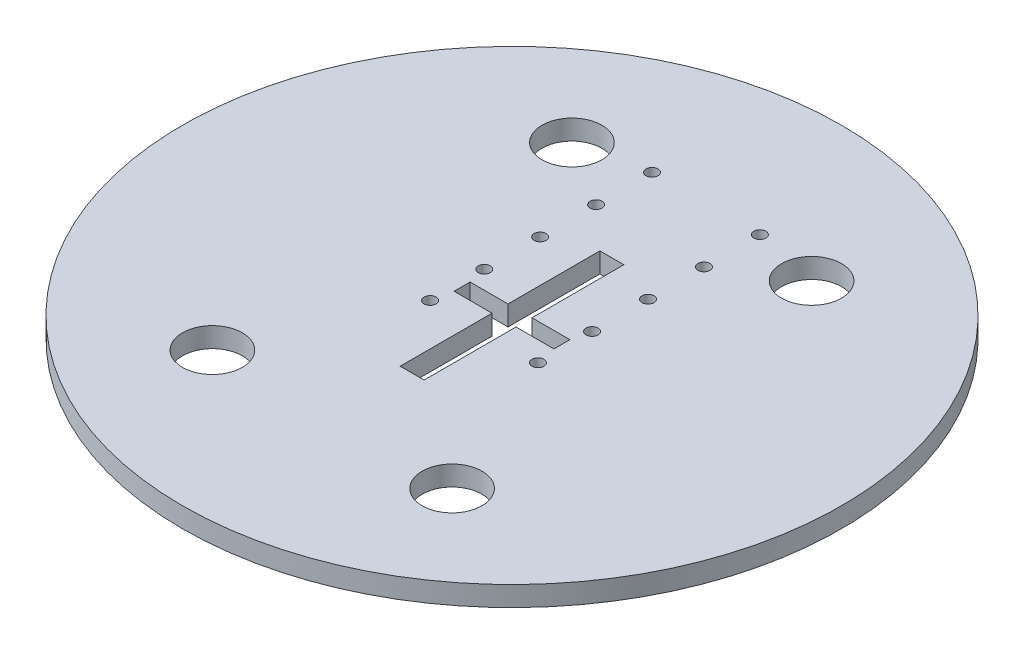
from build123d import *

# Parameters (mm, degrees)
SKETCH1_R           = 82.5
BOSS_EXTRUDE1_DEPTH = 5
SKETCH5_R           = 7.5
CUT_EXTRUDE3_DEPTH  = 117.779707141
SKETCH6_W           = 6
SKETCH6_H           = 50
CUT_EXTRUDE4_DEPTH  = 117.779707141
SKETCH7_W           = 25
SKETCH7_H           = 4
CUT_EXTRUDE5_DEPTH  = 117.779707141
SKETCH3_R           = 1.5
CUT_EXTRUDE10_DEPTH = 117.779707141


with BuildPart() as part:
    # Sketch1 → Boss-Extrude1 (new body)
    with BuildSketch(Plane(origin=(0, 0, 0), x_dir=(1, 0, 0), z_dir=(0, 1, 0))):
        with Locations(Location((0, 0, 0), (0, 0, 270))):
            Circle(SKETCH1_R)
    extrude(amount=BOSS_EXTRUDE1_DEPTH)

    # Sketch5 → Cut-Extrude3 (cut, through all)
    with BuildSketch(Plane(origin=(0, 5, 0), x_dir=(1, 0, 0), z_dir=(0, 1, 0))):
        with Locations(Location((30, -45, 0), (0, 0, 270))):
            Circle(SKETCH5_R)
        with Locations(Location((-30, -45, 0), (0, 0, 90))):
            Circle(SKETCH5_R)
        with Locations(Location((30, 45, 0), (0, 0, 90))):
            Circle(SKETCH5_R)
        with Locations(Location((-30, 45, 0), (0, 0, 270))):
            Circle(SKETCH5_R)
    extrude(amount=-CUT_EXTRUDE3_DEPTH, mode=Mode.SUBTRACT)

    # Sketch6 → Cut-Extrude4 (cut, through all)
    with BuildSketch(Plane(origin=(0, 5, 0), x_dir=(1, 0, 0), z_dir=(0, 1, 0))):
        Rectangle(SKETCH6_W, SKETCH6_H)
    extrude(amount=-CUT_EXTRUDE4_DEPTH, mode=Mode.SUBTRACT)

    # Sketch7 → Cut-Extrude5 (cut, through all)
    with BuildSketch(Plane(origin=(0, 5, 0), x_dir=(1, 0, 0), z_dir=(0, 1, 0))):
        Rectangle(SKETCH7_W, SKETCH7_H)
    extrude(amount=-CUT_EXTRUDE5_DEPTH, mode=Mode.SUBTRACT)

    # Sketch3 → Cut-Extrude10 (cut, through all)
    with BuildSketch(Plane(origin=(0, 5, 0), x_dir=(1, 0, 0), z_dir=(0, 1, 0))):
        with Locations(Location((-13.5, 6.55, 0), (0, 0, 270))):
            Circle(SKETCH3_R)
        with Locations(Location((-13.5, -7, 0), (0, 0, 270))):
            Circle(SKETCH3_R)
        with Locations(Location((-13.5, 20.55, 0), (0, 0, 270))):
            Circle(SKETCH3_R)
        with Locations(Location((-13.5, 34.55, 0), (0, 0, 270))):
            Circle(SKETCH3_R)
        with Locations(Location((-13.5, 48.55, 0), (0, 0, 270))):
            Circle(SKETCH3_R)
        with Locations(Location((13.5, -7, 0), (0, 0, 90))):
            Circle(SKETCH3_R)
        with Locations(Location((13.5, 6.55, 0), (0, 0, 90))):
            Circle(SKETCH3_R)
        with Locations(Location((13.5, 20.55, 0), (0, 0, 90))):
            Circle(SKETCH3_R)
        with Locations(Location((13.5, 34.55, 0), (0, 0, 90))):
            Circle(SKETCH3_R)
        with Locations(Location((13.5, 48.55, 0), (0, 0, 90))):
            Circle(SKETCH3_R)
    extrude(amount=-CUT_EXTRUDE10_DEPTH, mode=Mode.SUBTRACT)


solid = part.part
